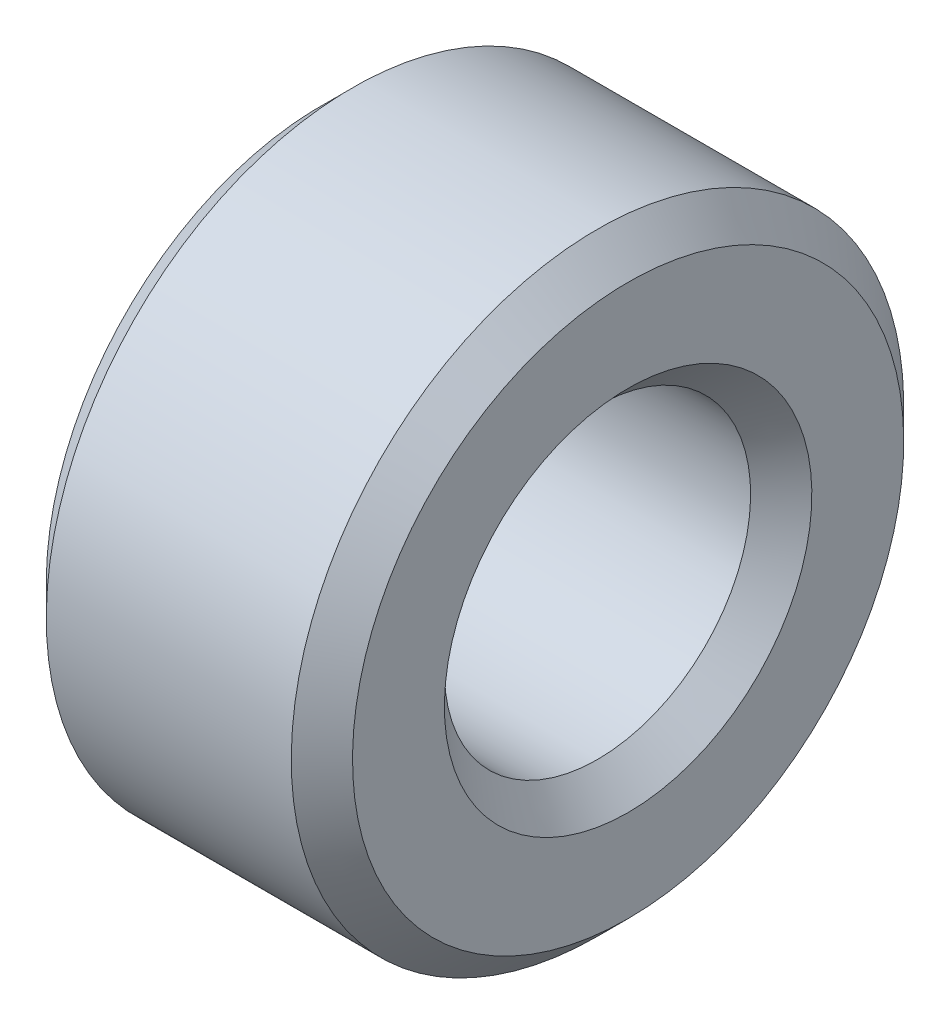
ISO-10303-21;
HEADER;
FILE_DESCRIPTION(('STEP AP214'),'2;1');
FILE_NAME('part.step','',(''),(''),'','','');
FILE_SCHEMA(('AUTOMOTIVE_DESIGN { 1 0 10303 214 1 1 1 1 }'));
ENDSEC;
DATA;
#1=APPLICATION_CONTEXT('core data for automotive mechanical design processes');
#2=APPLICATION_PROTOCOL_DEFINITION('international standard','automotive_design',2000,#1);
#3=PRODUCT_CONTEXT('',#1,'mechanical');
#4=PRODUCT('Part','Part','',(#3));
#5=PRODUCT_RELATED_PRODUCT_CATEGORY('part','',(#4));
#6=PRODUCT_DEFINITION_FORMATION('','',#4);
#7=PRODUCT_DEFINITION_CONTEXT('part definition',#1,'design');
#8=PRODUCT_DEFINITION('design','',#6,#7);
#9=PRODUCT_DEFINITION_SHAPE('','',#8);
#10=(LENGTH_UNIT() NAMED_UNIT(*) SI_UNIT(.MILLI.,.METRE.));
#11=(NAMED_UNIT(*) PLANE_ANGLE_UNIT() SI_UNIT($,.RADIAN.));
#12=(NAMED_UNIT(*) SI_UNIT($,.STERADIAN.) SOLID_ANGLE_UNIT());
#13=UNCERTAINTY_MEASURE_WITH_UNIT(LENGTH_MEASURE(1.E-05),#10,'distance_accuracy_value','');
#14=(GEOMETRIC_REPRESENTATION_CONTEXT(3) GLOBAL_UNCERTAINTY_ASSIGNED_CONTEXT((#13)) GLOBAL_UNIT_ASSIGNED_CONTEXT((#10,
#11,#12)) REPRESENTATION_CONTEXT('',''));
#15=CARTESIAN_POINT('',(0.,0.,0.));
#16=DIRECTION('',(0.,0.,1.));
#17=DIRECTION('',(1.,0.,0.));
#18=AXIS2_PLACEMENT_3D('',#15,#16,#17);
#19=CARTESIAN_POINT('',(0.,-3.,0.));
#20=DIRECTION('',(-1.,0.,0.));
#21=DIRECTION('',(0.,1.,0.));
#22=AXIS2_PLACEMENT_3D('',#19,#20,#21);
#23=PLANE('',#22);
#24=CARTESIAN_POINT('',(0.,0.,0.));
#25=DIRECTION('',(1.,0.,0.));
#26=DIRECTION('',(0.,-1.,0.));
#27=AXIS2_PLACEMENT_3D('',#24,#25,#26);
#28=CIRCLE('',#27,2.4);
#29=CARTESIAN_POINT('',(0.,-2.4,0.));
#30=VERTEX_POINT('',#29);
#31=EDGE_CURVE('E9',#30,#30,#28,.T.);
#32=ORIENTED_EDGE('',*,*,#31,.T.);
#33=EDGE_LOOP('',(#32));
#34=FACE_BOUND('',#33,.T.);
#35=CARTESIAN_POINT('',(0.,0.,0.));
#36=DIRECTION('',(1.,0.,0.));
#37=DIRECTION('',(0.,-1.,0.));
#38=AXIS2_PLACEMENT_3D('',#35,#36,#37);
#39=CIRCLE('',#38,3.6);
#40=CARTESIAN_POINT('',(0.,-3.6,0.));
#41=VERTEX_POINT('',#40);
#42=EDGE_CURVE('E53',#41,#41,#39,.T.);
#43=ORIENTED_EDGE('',*,*,#42,.F.);
#44=EDGE_LOOP('',(#43));
#45=FACE_BOUND('',#44,.T.);
#46=ADVANCED_FACE('F15',(#34,#45),#23,.T.);
#47=CARTESIAN_POINT('',(0.2,0.,0.));
#48=DIRECTION('',(-1.,0.,0.));
#49=DIRECTION('',(0.,-1.,0.));
#50=AXIS2_PLACEMENT_3D('',#47,#48,#49);
#51=CONICAL_SURFACE('',#50,2.2,0.785398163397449);
#52=CARTESIAN_POINT('',(0.4,0.,0.));
#53=DIRECTION('',(1.,0.,0.));
#54=DIRECTION('',(0.,-1.,0.));
#55=AXIS2_PLACEMENT_3D('',#52,#53,#54);
#56=CIRCLE('',#55,2.);
#57=CARTESIAN_POINT('',(0.4,-2.,0.));
#58=VERTEX_POINT('',#57);
#59=EDGE_CURVE('E22',#58,#58,#56,.T.);
#60=ORIENTED_EDGE('',*,*,#59,.T.);
#61=EDGE_LOOP('',(#60));
#62=FACE_BOUND('',#61,.T.);
#63=ORIENTED_EDGE('',*,*,#31,.F.);
#64=EDGE_LOOP('',(#63));
#65=FACE_BOUND('',#64,.T.);
#66=ADVANCED_FACE('F82',(#62,#65),#51,.F.);
#67=CARTESIAN_POINT('',(2.,0.,0.));
#68=DIRECTION('',(-1.,0.,0.));
#69=DIRECTION('',(0.,-1.,0.));
#70=AXIS2_PLACEMENT_3D('',#67,#68,#69);
#71=CYLINDRICAL_SURFACE('',#70,2.);
#72=CARTESIAN_POINT('',(3.6,0.,0.));
#73=DIRECTION('',(1.,0.,0.));
#74=DIRECTION('',(0.,-1.,0.));
#75=AXIS2_PLACEMENT_3D('',#72,#73,#74);
#76=CIRCLE('',#75,2.);
#77=CARTESIAN_POINT('',(3.6,-2.,0.));
#78=VERTEX_POINT('',#77);
#79=EDGE_CURVE('E58',#78,#78,#76,.T.);
#80=ORIENTED_EDGE('',*,*,#79,.T.);
#81=EDGE_LOOP('',(#80));
#82=FACE_BOUND('',#81,.T.);
#83=ORIENTED_EDGE('',*,*,#59,.F.);
#84=EDGE_LOOP('',(#83));
#85=FACE_BOUND('',#84,.T.);
#86=ADVANCED_FACE('F66',(#82,#85),#71,.F.);
#87=CARTESIAN_POINT('',(3.8,0.,0.));
#88=DIRECTION('',(1.,0.,0.));
#89=DIRECTION('',(0.,-1.,0.));
#90=AXIS2_PLACEMENT_3D('',#87,#88,#89);
#91=CONICAL_SURFACE('',#90,2.2,0.78539816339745);
#92=CARTESIAN_POINT('',(4.,0.,0.));
#93=DIRECTION('',(1.,0.,0.));
#94=DIRECTION('',(0.,-1.,0.));
#95=AXIS2_PLACEMENT_3D('',#92,#93,#94);
#96=CIRCLE('',#95,2.4);
#97=CARTESIAN_POINT('',(4.,-2.4,0.));
#98=VERTEX_POINT('',#97);
#99=EDGE_CURVE('E63',#98,#98,#96,.T.);
#100=ORIENTED_EDGE('',*,*,#99,.T.);
#101=EDGE_LOOP('',(#100));
#102=FACE_BOUND('',#101,.T.);
#103=ORIENTED_EDGE('',*,*,#79,.F.);
#104=EDGE_LOOP('',(#103));
#105=FACE_BOUND('',#104,.T.);
#106=ADVANCED_FACE('F69',(#102,#105),#91,.F.);
#107=CARTESIAN_POINT('',(4.,-3.,0.));
#108=DIRECTION('',(1.,0.,0.));
#109=DIRECTION('',(0.,-1.,0.));
#110=AXIS2_PLACEMENT_3D('',#107,#108,#109);
#111=PLANE('',#110);
#112=CARTESIAN_POINT('',(4.,0.,0.));
#113=DIRECTION('',(1.,0.,0.));
#114=DIRECTION('',(0.,-1.,0.));
#115=AXIS2_PLACEMENT_3D('',#112,#113,#114);
#116=CIRCLE('',#115,3.6);
#117=CARTESIAN_POINT('',(4.,-3.6,0.));
#118=VERTEX_POINT('',#117);
#119=EDGE_CURVE('E61',#118,#118,#116,.T.);
#120=ORIENTED_EDGE('',*,*,#119,.T.);
#121=EDGE_LOOP('',(#120));
#122=FACE_BOUND('',#121,.T.);
#123=ORIENTED_EDGE('',*,*,#99,.F.);
#124=EDGE_LOOP('',(#123));
#125=FACE_BOUND('',#124,.T.);
#126=ADVANCED_FACE('F71',(#122,#125),#111,.T.);
#127=CARTESIAN_POINT('',(3.8,0.,0.));
#128=DIRECTION('',(-1.,0.,0.));
#129=DIRECTION('',(0.,-1.,0.));
#130=AXIS2_PLACEMENT_3D('',#127,#128,#129);
#131=CONICAL_SURFACE('',#130,3.8,0.785398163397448);
#132=CARTESIAN_POINT('',(3.6,0.,0.));
#133=DIRECTION('',(1.,0.,0.));
#134=DIRECTION('',(0.,-1.,0.));
#135=AXIS2_PLACEMENT_3D('',#132,#133,#134);
#136=CIRCLE('',#135,4.);
#137=CARTESIAN_POINT('',(3.6,-4.,0.));
#138=VERTEX_POINT('',#137);
#139=EDGE_CURVE('E55',#138,#138,#136,.T.);
#140=ORIENTED_EDGE('',*,*,#139,.T.);
#141=EDGE_LOOP('',(#140));
#142=FACE_BOUND('',#141,.T.);
#143=ORIENTED_EDGE('',*,*,#119,.F.);
#144=EDGE_LOOP('',(#143));
#145=FACE_BOUND('',#144,.T.);
#146=ADVANCED_FACE('F79',(#142,#145),#131,.T.);
#147=CARTESIAN_POINT('',(2.,0.,0.));
#148=DIRECTION('',(-1.,0.,0.));
#149=DIRECTION('',(0.,-1.,0.));
#150=AXIS2_PLACEMENT_3D('',#147,#148,#149);
#151=CYLINDRICAL_SURFACE('',#150,4.);
#152=CARTESIAN_POINT('',(0.4,0.,0.));
#153=DIRECTION('',(1.,0.,0.));
#154=DIRECTION('',(0.,-1.,0.));
#155=AXIS2_PLACEMENT_3D('',#152,#153,#154);
#156=CIRCLE('',#155,4.);
#157=CARTESIAN_POINT('',(0.4,-4.,0.));
#158=VERTEX_POINT('',#157);
#159=EDGE_CURVE('E49',#158,#158,#156,.T.);
#160=ORIENTED_EDGE('',*,*,#159,.T.);
#161=EDGE_LOOP('',(#160));
#162=FACE_BOUND('',#161,.T.);
#163=ORIENTED_EDGE('',*,*,#139,.F.);
#164=EDGE_LOOP('',(#163));
#165=FACE_BOUND('',#164,.T.);
#166=ADVANCED_FACE('F50',(#162,#165),#151,.T.);
#167=CARTESIAN_POINT('',(0.2,0.,0.));
#168=DIRECTION('',(1.,0.,0.));
#169=DIRECTION('',(0.,-1.,0.));
#170=AXIS2_PLACEMENT_3D('',#167,#168,#169);
#171=CONICAL_SURFACE('',#170,3.8,0.785398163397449);
#172=ORIENTED_EDGE('',*,*,#42,.T.);
#173=EDGE_LOOP('',(#172));
#174=FACE_BOUND('',#173,.T.);
#175=ORIENTED_EDGE('',*,*,#159,.F.);
#176=EDGE_LOOP('',(#175));
#177=FACE_BOUND('',#176,.T.);
#178=ADVANCED_FACE('F92',(#174,#177),#171,.T.);
#179=CLOSED_SHELL('',(#46,#66,#86,#106,#126,#146,#166,#178));
#180=MANIFOLD_SOLID_BREP('B1',#179);
#181=ADVANCED_BREP_SHAPE_REPRESENTATION('',(#18,#180),#14);
#182=SHAPE_DEFINITION_REPRESENTATION(#9,#181);
ENDSEC;
END-ISO-10303-21;
